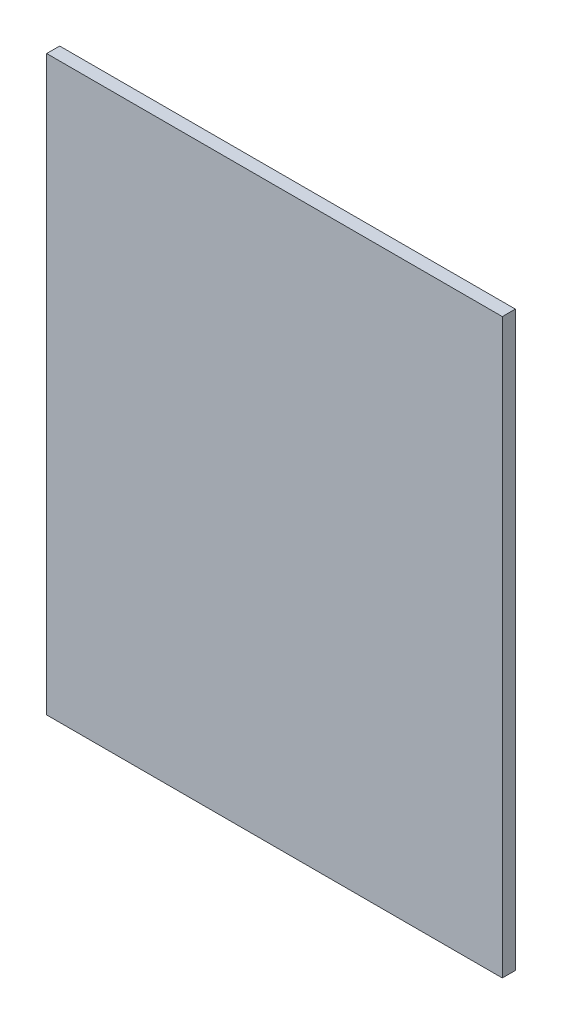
from build123d import *

# Parameters (mm, degrees)
SKETCH1_W           = 350
SKETCH1_H           = 440
BOSS_EXTRUDE1_DEPTH = 5


with BuildPart() as part:
    # Sketch1 → Boss-Extrude1 (new, symmetric)
    with BuildSketch(Plane.XY):
        Rectangle(SKETCH1_W, SKETCH1_H)
    extrude(amount=BOSS_EXTRUDE1_DEPTH, both=True)


solid = part.part
